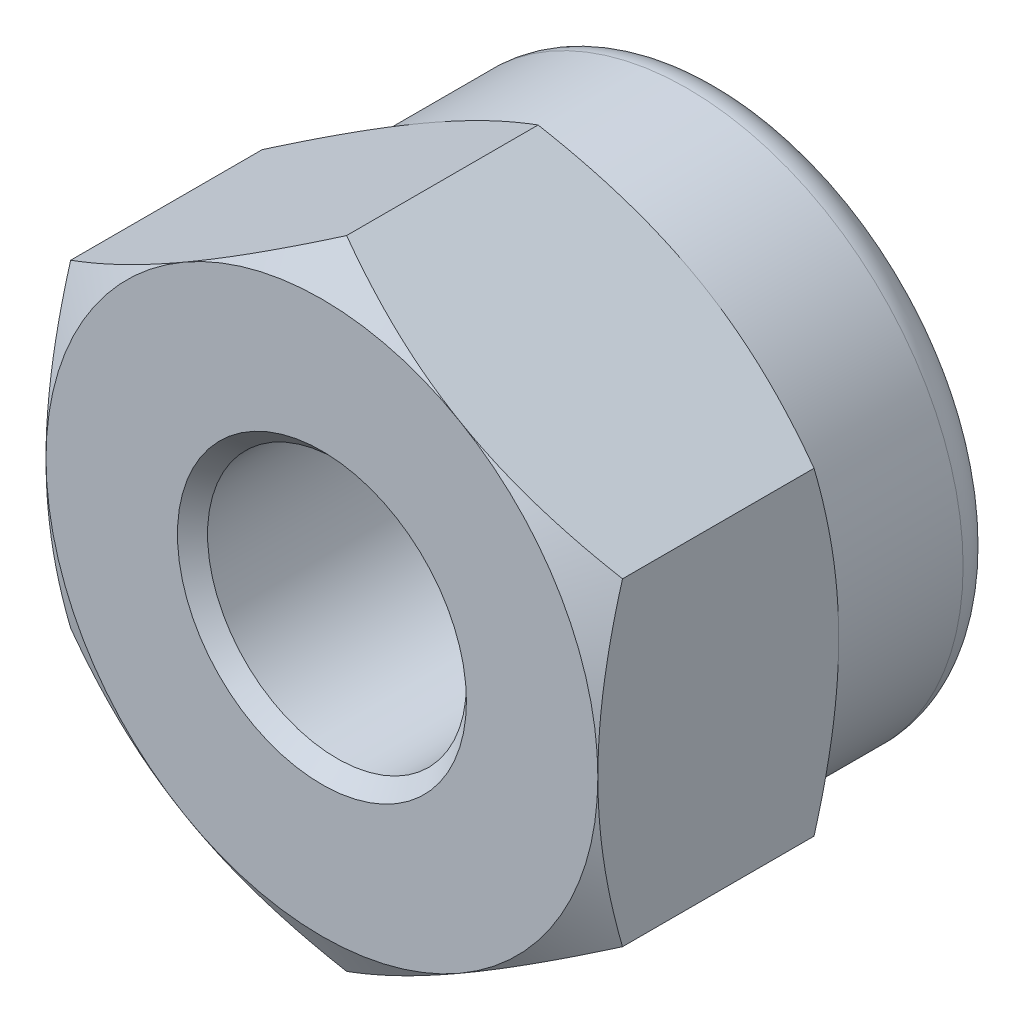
from build123d import *

# Parameters (mm, degrees)
SKETCH_7_R          = 1.29
EXTRUDE_1_DEPTH     = 2.4
SKETCH_5_R          = 2.75
SKETCH_5_R_2        = 1.65
EXTRUDE_4_DEPTH     = 1.6
FILLET_2_R          = 0.36
SKETCH_6_R          = 2.0625
CUT_EXTRUDE_1_DEPTH = 0.4
FILLET_3_R          = 0.075
CHAMFER_2_SIZE      = 0.15


with BuildPart() as part:
    # Sketch 7 → Extrude 1 (new body)
    with BuildSketch(Plane.XY):
        Polygon((0, 3.175426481), (-2.75, 1.58771324), (-2.75, -1.58771324), (0, -3.175426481), (2.75, -1.58771324), (2.75, 1.58771324), align=None)
        Circle(SKETCH_7_R, mode=Mode.SUBTRACT)
    extrude(amount=-EXTRUDE_1_DEPTH)

    # Sketch 2 → Cut-Revolve 1 (revolve, cut)
    with BuildSketch(Plane(origin=(0, 0, 0), x_dir=(0, 0, -1), z_dir=(1, 0, 0))):
        Polygon((0, 2.75), (0.245620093, 3.175426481), (0, 3.175426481), align=None)
        Polygon((2.4, 2.75), (2.154379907, 3.175426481), (2.4, 3.175426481), align=None)
    revolve(axis=Axis((0, 0, 0), (0, 0, -1)), mode=Mode.SUBTRACT)

    # Sketch 5 → Extrude 4 (add)
    with BuildSketch(Plane(origin=(0, 0, -2.4), x_dir=(-1, 0, 0), z_dir=(0, 0, -1))):
        Circle(SKETCH_5_R)
        Circle(SKETCH_5_R_2, mode=Mode.SUBTRACT)
    extrude(amount=EXTRUDE_4_DEPTH)

    # Fillet 2
    fillet_2_edges = [part.edges().sort_by_distance(p)[0] for p in [
        (2.75, 0, -4),
    ]]
    fillet(fillet_2_edges, radius=FILLET_2_R)

    # Sketch 6 → Cut-Extrude 1 (cut)
    with BuildSketch(Plane(origin=(0, 0, -4), x_dir=(-1, 0, 0), z_dir=(0, 0, -1))):
        Circle(SKETCH_6_R)
    extrude(amount=-CUT_EXTRUDE_1_DEPTH, mode=Mode.SUBTRACT)

    # Fillet 3
    fillet_3_edges = [part.edges().sort_by_distance(p)[0] for p in [
        (2.0625, 0, -4),
    ]]
    fillet(fillet_3_edges, radius=FILLET_3_R)

    # Chamfer 2
    chamfer_2_edges = [part.edges().sort_by_distance(p)[0] for p in [
        (-1.29, 0, -2.4),
        (-1.29, 0, 0),
    ]]
    chamfer(chamfer_2_edges, length=CHAMFER_2_SIZE)


solid = part.part
